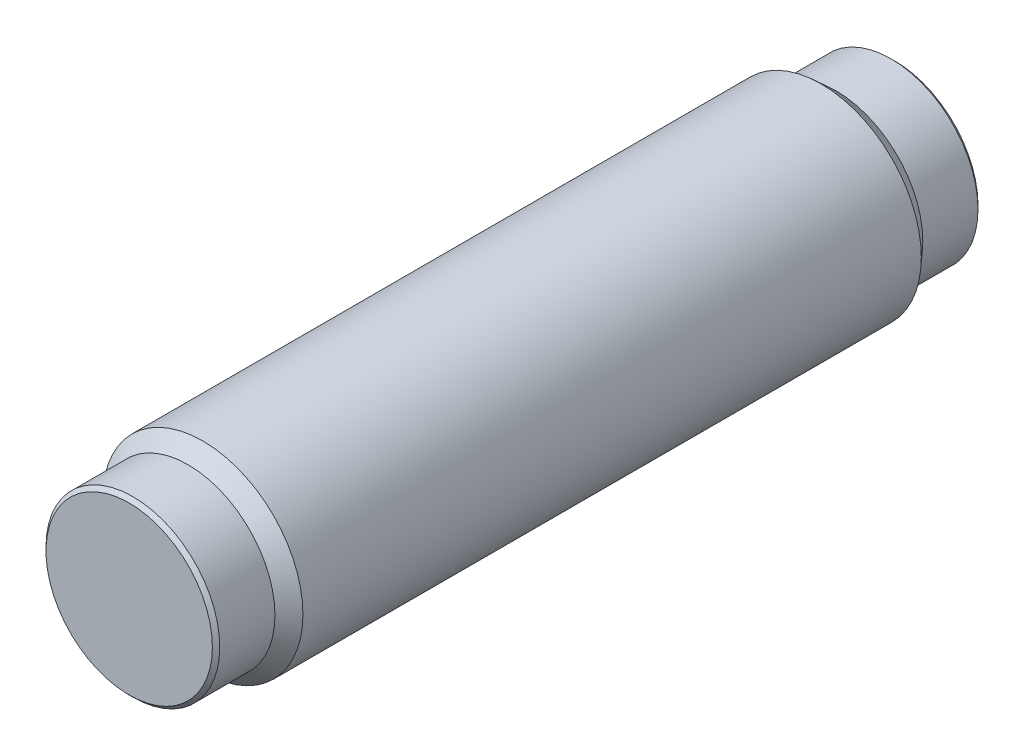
ISO-10303-21;
HEADER;
FILE_DESCRIPTION(('STEP AP214'),'2;1');
FILE_NAME('part.step','',(''),(''),'','','');
FILE_SCHEMA(('AUTOMOTIVE_DESIGN { 1 0 10303 214 1 1 1 1 }'));
ENDSEC;
DATA;
#1=APPLICATION_CONTEXT('core data for automotive mechanical design processes');
#2=APPLICATION_PROTOCOL_DEFINITION('international standard','automotive_design',2000,#1);
#3=PRODUCT_CONTEXT('',#1,'mechanical');
#4=PRODUCT('Part','Part','',(#3));
#5=PRODUCT_RELATED_PRODUCT_CATEGORY('part','',(#4));
#6=PRODUCT_DEFINITION_FORMATION('','',#4);
#7=PRODUCT_DEFINITION_CONTEXT('part definition',#1,'design');
#8=PRODUCT_DEFINITION('design','',#6,#7);
#9=PRODUCT_DEFINITION_SHAPE('','',#8);
#10=(LENGTH_UNIT() NAMED_UNIT(*) SI_UNIT(.MILLI.,.METRE.));
#11=(NAMED_UNIT(*) PLANE_ANGLE_UNIT() SI_UNIT($,.RADIAN.));
#12=(NAMED_UNIT(*) SI_UNIT($,.STERADIAN.) SOLID_ANGLE_UNIT());
#13=UNCERTAINTY_MEASURE_WITH_UNIT(LENGTH_MEASURE(1.E-05),#10,'distance_accuracy_value','');
#14=(GEOMETRIC_REPRESENTATION_CONTEXT(3) GLOBAL_UNCERTAINTY_ASSIGNED_CONTEXT((#13)) GLOBAL_UNIT_ASSIGNED_CONTEXT((#10,
#11,#12)) REPRESENTATION_CONTEXT('',''));
#15=CARTESIAN_POINT('',(0.,0.,0.));
#16=DIRECTION('',(0.,0.,1.));
#17=DIRECTION('',(1.,0.,0.));
#18=AXIS2_PLACEMENT_3D('',#15,#16,#17);
#19=CARTESIAN_POINT('',(0.,0.,10.5));
#20=DIRECTION('',(0.,0.,-1.));
#21=DIRECTION('',(-1.,0.,0.));
#22=AXIS2_PLACEMENT_3D('',#19,#20,#21);
#23=CYLINDRICAL_SURFACE('',#22,3.4);
#24=CARTESIAN_POINT('',(0.,0.,10.5));
#25=DIRECTION('',(0.,0.,1.));
#26=DIRECTION('',(1.,0.,0.));
#27=AXIS2_PLACEMENT_3D('',#24,#25,#26);
#28=CIRCLE('',#27,3.4);
#29=CARTESIAN_POINT('',(-3.4,0.,10.5));
#30=VERTEX_POINT('',#29);
#31=EDGE_CURVE('E61',#30,#30,#28,.T.);
#32=CARTESIAN_POINT('',(0.,0.,-10.5));
#33=DIRECTION('',(0.,0.,1.));
#34=DIRECTION('',(1.,0.,0.));
#35=AXIS2_PLACEMENT_3D('',#32,#33,#34);
#36=CIRCLE('',#35,3.4);
#37=CARTESIAN_POINT('',(-3.4,0.,-10.5));
#38=VERTEX_POINT('',#37);
#39=EDGE_CURVE('E69',#38,#38,#36,.T.);
#40=CARTESIAN_POINT('',(-3.4,0.,10.5));
#41=CARTESIAN_POINT('',(-3.4,0.,10.28125));
#42=CARTESIAN_POINT('',(-3.4,0.,10.0625));
#43=CARTESIAN_POINT('',(-3.4,0.,9.625));
#44=CARTESIAN_POINT('',(-3.4,0.,9.40625));
#45=CARTESIAN_POINT('',(-3.4,0.,8.96875));
#46=CARTESIAN_POINT('',(-3.4,0.,8.75));
#47=CARTESIAN_POINT('',(-3.4,0.,8.3125));
#48=CARTESIAN_POINT('',(-3.4,0.,8.09375));
#49=CARTESIAN_POINT('',(-3.4,0.,7.65625));
#50=CARTESIAN_POINT('',(-3.4,0.,7.4375));
#51=CARTESIAN_POINT('',(-3.4,0.,7.));
#52=CARTESIAN_POINT('',(-3.4,0.,6.78125));
#53=CARTESIAN_POINT('',(-3.4,0.,6.34375));
#54=CARTESIAN_POINT('',(-3.4,0.,6.125));
#55=CARTESIAN_POINT('',(-3.4,0.,5.6875));
#56=CARTESIAN_POINT('',(-3.4,0.,5.46875));
#57=CARTESIAN_POINT('',(-3.4,0.,5.03125));
#58=CARTESIAN_POINT('',(-3.4,0.,4.8125));
#59=CARTESIAN_POINT('',(-3.4,0.,4.375));
#60=CARTESIAN_POINT('',(-3.4,0.,4.15625));
#61=CARTESIAN_POINT('',(-3.4,0.,3.71875));
#62=CARTESIAN_POINT('',(-3.4,0.,3.5));
#63=CARTESIAN_POINT('',(-3.4,0.,3.0625));
#64=CARTESIAN_POINT('',(-3.4,0.,2.84375));
#65=CARTESIAN_POINT('',(-3.4,0.,2.40625));
#66=CARTESIAN_POINT('',(-3.4,0.,2.1875));
#67=CARTESIAN_POINT('',(-3.4,0.,1.75));
#68=CARTESIAN_POINT('',(-3.4,0.,1.53125));
#69=CARTESIAN_POINT('',(-3.4,0.,1.09375));
#70=CARTESIAN_POINT('',(-3.4,0.,0.874999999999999));
#71=CARTESIAN_POINT('',(-3.4,0.,0.437499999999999));
#72=CARTESIAN_POINT('',(-3.4,0.,0.218749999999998));
#73=CARTESIAN_POINT('',(-3.4,0.,-0.218750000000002));
#74=CARTESIAN_POINT('',(-3.4,0.,-0.437500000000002));
#75=CARTESIAN_POINT('',(-3.4,0.,-0.875000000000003));
#76=CARTESIAN_POINT('',(-3.4,0.,-1.09375));
#77=CARTESIAN_POINT('',(-3.4,0.,-1.53125));
#78=CARTESIAN_POINT('',(-3.4,0.,-1.75));
#79=CARTESIAN_POINT('',(-3.4,0.,-2.1875));
#80=CARTESIAN_POINT('',(-3.4,0.,-2.40625));
#81=CARTESIAN_POINT('',(-3.4,0.,-2.84375));
#82=CARTESIAN_POINT('',(-3.4,0.,-3.0625));
#83=CARTESIAN_POINT('',(-3.4,0.,-3.5));
#84=CARTESIAN_POINT('',(-3.4,0.,-3.71875));
#85=CARTESIAN_POINT('',(-3.4,0.,-4.15625));
#86=CARTESIAN_POINT('',(-3.4,0.,-4.375));
#87=CARTESIAN_POINT('',(-3.4,0.,-4.8125));
#88=CARTESIAN_POINT('',(-3.4,0.,-5.03125));
#89=CARTESIAN_POINT('',(-3.4,0.,-5.46875));
#90=CARTESIAN_POINT('',(-3.4,0.,-5.6875));
#91=CARTESIAN_POINT('',(-3.4,0.,-6.125));
#92=CARTESIAN_POINT('',(-3.4,0.,-6.34375));
#93=CARTESIAN_POINT('',(-3.4,0.,-6.78125));
#94=CARTESIAN_POINT('',(-3.4,0.,-7.));
#95=CARTESIAN_POINT('',(-3.4,0.,-7.4375));
#96=CARTESIAN_POINT('',(-3.4,0.,-7.65625));
#97=CARTESIAN_POINT('',(-3.4,0.,-8.09375));
#98=CARTESIAN_POINT('',(-3.4,0.,-8.3125));
#99=CARTESIAN_POINT('',(-3.4,0.,-8.75));
#100=CARTESIAN_POINT('',(-3.4,0.,-8.96875));
#101=CARTESIAN_POINT('',(-3.4,0.,-9.40625));
#102=CARTESIAN_POINT('',(-3.4,0.,-9.625));
#103=CARTESIAN_POINT('',(-3.4,0.,-10.0625));
#104=CARTESIAN_POINT('',(-3.4,0.,-10.28125));
#105=CARTESIAN_POINT('',(-3.4,0.,-10.5));
#106=B_SPLINE_CURVE_WITH_KNOTS('',3,(#40,#41,#42,#43,#44,#45,#46,#47,#48,#49,#50,#51,#52,#53,
#54,#55,#56,#57,#58,#59,#60,#61,#62,#63,#64,#65,#66,#67,#68,#69,#70,#71,#72,#73,#74,#75,#76,#77,
#78,#79,#80,#81,#82,#83,#84,#85,#86,#87,#88,#89,#90,#91,#92,#93,#94,#95,#96,#97,#98,#99,#100,
#101,#102,#103,#104,#105),.UNSPECIFIED.,.F.,.F.,(4,2,2,2,2,2,2,2,2,2,2,2,2,2,2,2,2,2,2,2,2,2,2,
2,2,2,2,2,2,2,2,2,4),(0.,0.656249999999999,1.3125,1.96875,2.625,3.28125,3.9375,4.59375,5.25,
5.90625,6.5625,7.21875,7.875,8.53125,9.1875,9.84375,10.5,11.15625,11.8125,12.46875,13.125,
13.78125,14.4375,15.09375,15.75,16.40625,17.0625,17.71875,18.375,19.03125,19.6875,20.34375,21.),.UNSPECIFIED.);
#107=EDGE_CURVE('BSEAM37',#30,#38,#106,.T.);
#108=ORIENTED_EDGE('',*,*,#31,.F.);
#109=ORIENTED_EDGE('',*,*,#39,.T.);
#110=ORIENTED_EDGE('',*,*,#107,.T.);
#111=ORIENTED_EDGE('',*,*,#107,.F.);
#112=EDGE_LOOP('',(#108,#110,#109,#111));
#113=FACE_BOUND('',#112,.T.);
#114=ADVANCED_FACE('F37',(#113),#23,.T.);
#115=CARTESIAN_POINT('',(0.,0.,13.));
#116=DIRECTION('',(0.,0.,1.));
#117=DIRECTION('',(1.,0.,0.));
#118=AXIS2_PLACEMENT_3D('',#115,#116,#117);
#119=PLANE('',#118);
#120=CARTESIAN_POINT('',(0.,0.,13.));
#121=DIRECTION('',(0.,0.,1.));
#122=DIRECTION('',(1.,0.,0.));
#123=AXIS2_PLACEMENT_3D('',#120,#121,#122);
#124=CIRCLE('',#123,2.82499999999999);
#125=CARTESIAN_POINT('',(2.82499999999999,0.,13.));
#126=VERTEX_POINT('',#125);
#127=EDGE_CURVE('E55',#126,#126,#124,.T.);
#128=ORIENTED_EDGE('',*,*,#127,.T.);
#129=EDGE_LOOP('',(#128));
#130=FACE_BOUND('',#129,.T.);
#131=ADVANCED_FACE('F94',(#130),#119,.T.);
#132=CARTESIAN_POINT('',(0.,0.,13.));
#133=DIRECTION('',(0.,0.,1.));
#134=DIRECTION('',(1.,0.,0.));
#135=AXIS2_PLACEMENT_3D('',#132,#133,#134);
#136=CYLINDRICAL_SURFACE('',#135,2.95);
#137=CARTESIAN_POINT('',(0.,0.,12.875));
#138=DIRECTION('',(0.,0.,1.));
#139=DIRECTION('',(1.,0.,0.));
#140=AXIS2_PLACEMENT_3D('',#137,#138,#139);
#141=CIRCLE('',#140,2.95);
#142=CARTESIAN_POINT('',(2.95,0.,12.875));
#143=VERTEX_POINT('',#142);
#144=EDGE_CURVE('E50',#143,#143,#141,.F.);
#145=ORIENTED_EDGE('',*,*,#144,.T.);
#146=EDGE_LOOP('',(#145));
#147=FACE_BOUND('',#146,.T.);
#148=CARTESIAN_POINT('',(0.,0.,11.));
#149=DIRECTION('',(0.,0.,1.));
#150=DIRECTION('',(1.,0.,0.));
#151=AXIS2_PLACEMENT_3D('',#148,#149,#150);
#152=CIRCLE('',#151,2.95);
#153=CARTESIAN_POINT('',(2.95,0.,11.));
#154=VERTEX_POINT('',#153);
#155=EDGE_CURVE('E65',#154,#154,#152,.T.);
#156=ORIENTED_EDGE('',*,*,#155,.T.);
#157=EDGE_LOOP('',(#156));
#158=FACE_BOUND('',#157,.T.);
#159=ADVANCED_FACE('F100',(#147,#158),#136,.T.);
#160=CARTESIAN_POINT('',(0.,0.,11.));
#161=DIRECTION('',(0.,0.,-1.));
#162=DIRECTION('',(-1.,0.,0.));
#163=AXIS2_PLACEMENT_3D('',#160,#161,#162);
#164=CONICAL_SURFACE('',#163,2.95,0.732815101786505);
#165=ORIENTED_EDGE('',*,*,#31,.T.);
#166=EDGE_LOOP('',(#165));
#167=FACE_BOUND('',#166,.T.);
#168=ORIENTED_EDGE('',*,*,#155,.F.);
#169=EDGE_LOOP('',(#168));
#170=FACE_BOUND('',#169,.T.);
#171=ADVANCED_FACE('F90',(#167,#170),#164,.T.);
#172=CARTESIAN_POINT('',(0.,0.,-11.));
#173=DIRECTION('',(0.,0.,1.));
#174=DIRECTION('',(1.,0.,0.));
#175=AXIS2_PLACEMENT_3D('',#172,#173,#174);
#176=CONICAL_SURFACE('',#175,2.95,0.73281510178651);
#177=ORIENTED_EDGE('',*,*,#39,.F.);
#178=EDGE_LOOP('',(#177));
#179=FACE_BOUND('',#178,.T.);
#180=CARTESIAN_POINT('',(0.,0.,-11.));
#181=DIRECTION('',(0.,0.,1.));
#182=DIRECTION('',(1.,0.,0.));
#183=AXIS2_PLACEMENT_3D('',#180,#181,#182);
#184=CIRCLE('',#183,2.95);
#185=CARTESIAN_POINT('',(2.95,0.,-11.));
#186=VERTEX_POINT('',#185);
#187=EDGE_CURVE('E73',#186,#186,#184,.T.);
#188=ORIENTED_EDGE('',*,*,#187,.T.);
#189=EDGE_LOOP('',(#188));
#190=FACE_BOUND('',#189,.T.);
#191=ADVANCED_FACE('F78',(#179,#190),#176,.T.);
#192=CARTESIAN_POINT('',(0.,0.,13.));
#193=DIRECTION('',(0.,0.,1.));
#194=DIRECTION('',(1.,0.,0.));
#195=AXIS2_PLACEMENT_3D('',#192,#193,#194);
#196=CYLINDRICAL_SURFACE('',#195,2.95);
#197=CARTESIAN_POINT('',(0.,0.,-12.875));
#198=DIRECTION('',(0.,0.,1.));
#199=DIRECTION('',(1.,0.,0.));
#200=AXIS2_PLACEMENT_3D('',#197,#198,#199);
#201=CIRCLE('',#200,2.95);
#202=CARTESIAN_POINT('',(2.95,0.,-12.875));
#203=VERTEX_POINT('',#202);
#204=EDGE_CURVE('E45',#203,#203,#201,.T.);
#205=ORIENTED_EDGE('',*,*,#204,.T.);
#206=EDGE_LOOP('',(#205));
#207=FACE_BOUND('',#206,.T.);
#208=ORIENTED_EDGE('',*,*,#187,.F.);
#209=EDGE_LOOP('',(#208));
#210=FACE_BOUND('',#209,.T.);
#211=ADVANCED_FACE('F80',(#207,#210),#196,.T.);
#212=CARTESIAN_POINT('',(0.,0.,-13.));
#213=DIRECTION('',(0.,0.,1.));
#214=DIRECTION('',(1.,0.,0.));
#215=AXIS2_PLACEMENT_3D('',#212,#213,#214);
#216=PLANE('',#215);
#217=CARTESIAN_POINT('',(0.,0.,-13.));
#218=DIRECTION('',(0.,0.,1.));
#219=DIRECTION('',(1.,0.,0.));
#220=AXIS2_PLACEMENT_3D('',#217,#218,#219);
#221=CIRCLE('',#220,2.825);
#222=CARTESIAN_POINT('',(2.825,0.,-13.));
#223=VERTEX_POINT('',#222);
#224=EDGE_CURVE('E10',#223,#223,#221,.F.);
#225=ORIENTED_EDGE('',*,*,#224,.T.);
#226=EDGE_LOOP('',(#225));
#227=FACE_BOUND('',#226,.T.);
#228=ADVANCED_FACE('F82',(#227),#216,.F.);
#229=CARTESIAN_POINT('',(0.,0.,13.));
#230=DIRECTION('',(0.,0.,-1.));
#231=DIRECTION('',(-1.,0.,0.));
#232=AXIS2_PLACEMENT_3D('',#229,#230,#231);
#233=CONICAL_SURFACE('',#232,2.82499999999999,0.785398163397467);
#234=ORIENTED_EDGE('',*,*,#144,.F.);
#235=EDGE_LOOP('',(#234));
#236=FACE_BOUND('',#235,.T.);
#237=ORIENTED_EDGE('',*,*,#127,.F.);
#238=EDGE_LOOP('',(#237));
#239=FACE_BOUND('',#238,.T.);
#240=ADVANCED_FACE('F88',(#236,#239),#233,.T.);
#241=CARTESIAN_POINT('',(0.,0.,-12.875));
#242=DIRECTION('',(0.,0.,1.));
#243=DIRECTION('',(1.,0.,0.));
#244=AXIS2_PLACEMENT_3D('',#241,#242,#243);
#245=CONICAL_SURFACE('',#244,2.95,0.785398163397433);
#246=ORIENTED_EDGE('',*,*,#224,.F.);
#247=EDGE_LOOP('',(#246));
#248=FACE_BOUND('',#247,.T.);
#249=ORIENTED_EDGE('',*,*,#204,.F.);
#250=EDGE_LOOP('',(#249));
#251=FACE_BOUND('',#250,.T.);
#252=ADVANCED_FACE('F39',(#248,#251),#245,.T.);
#253=CLOSED_SHELL('',(#114,#131,#159,#171,#191,#211,#228,#240,#252));
#254=MANIFOLD_SOLID_BREP('B2',#253);
#255=ADVANCED_BREP_SHAPE_REPRESENTATION('',(#18,#254),#14);
#256=SHAPE_DEFINITION_REPRESENTATION(#9,#255);
ENDSEC;
END-ISO-10303-21;
